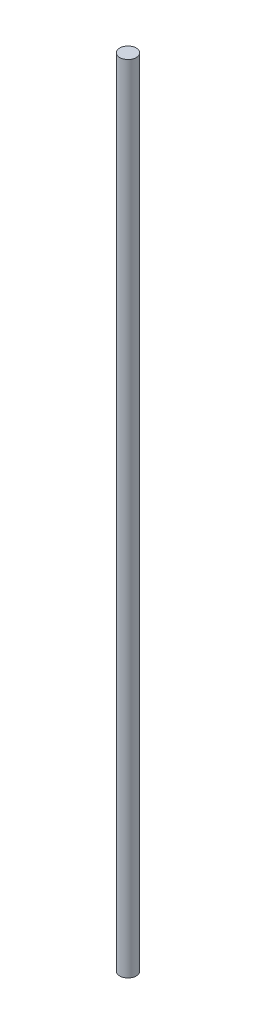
from build123d import *

# Parameters (mm, degrees)
SKETCH1_R      = 3.175
EXTRUDE1_DEPTH = 304.8


with BuildPart() as part:
    # Sketch1 → Extrude1 (new body)
    with BuildSketch(Plane(origin=(0, 0, 0), x_dir=(1, 0, 0), z_dir=(0, 1, 0))):
        with Locations(Location((0, 0, 0), (0, 0, 90))):
            Circle(SKETCH1_R)
    extrude(amount=EXTRUDE1_DEPTH)


solid = part.part
